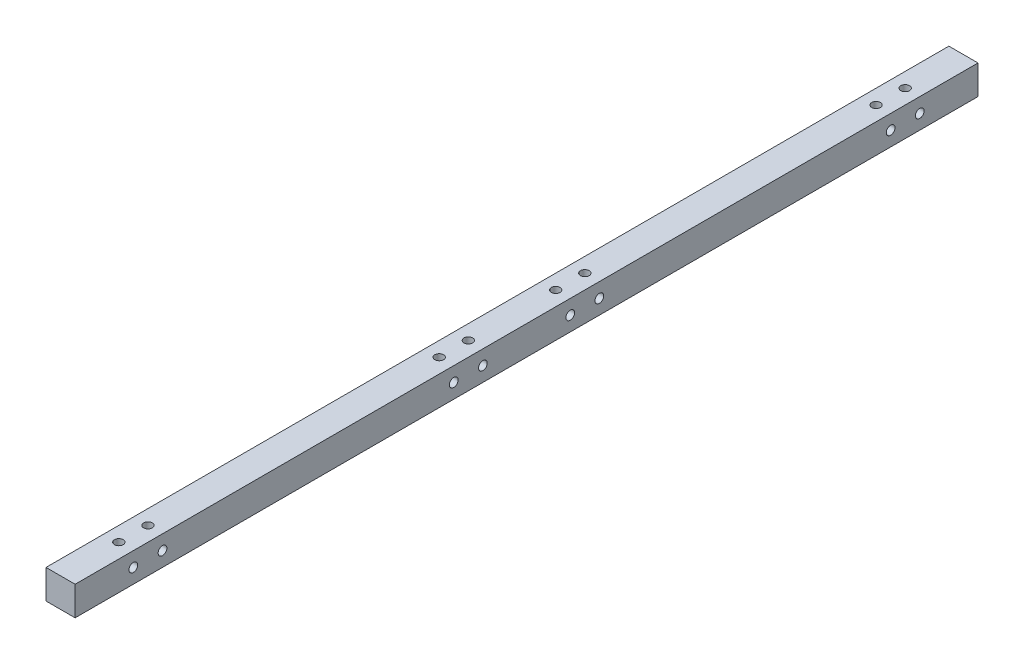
from build123d import *

# Parameters (mm, degrees)
ESQUISSE1_W             = 10
ESQUISSE1_H             = 10
EXTRUSION1_DEPTH        = 310
ESQUISSE2_R             = 1.5
ENL_V_MAT_EXTRU_1_DEPTH = 311.322412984
ESQUISSE3_R             = 1.5
ENL_V_MAT_EXTRU_2_DEPTH = 311.322412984


with BuildPart() as part:
    # Esquisse1 → Extrusion1 (new body)
    with BuildSketch(Plane.XY):
        with Locations((5, 5)):
            Rectangle(ESQUISSE1_W, ESQUISSE1_H)
    extrude(amount=EXTRUSION1_DEPTH)

    # Esquisse2 → Enl_v. mat.-Extru.1 (cut, through all)
    with BuildSketch(Plane(origin=(10, 0, 0), x_dir=(0, 0, -1), z_dir=(1, 0, 0))):
        with Locations((-170, 5)):
            Circle(ESQUISSE2_R)
        with Locations((-180, 5)):
            Circle(ESQUISSE2_R)
        with Locations(Location((-280, 5, 0), (0, 0, 180))):
            Circle(ESQUISSE2_R)
        with Locations(Location((-290, 5, 0), (0, 0, 180))):
            Circle(ESQUISSE2_R)
        with Locations((-20, 5)):
            Circle(ESQUISSE2_R)
        with Locations((-30, 5)):
            Circle(ESQUISSE2_R)
        with Locations(Location((-130, 5, 0), (0, 0, 180))):
            Circle(ESQUISSE2_R)
        with Locations(Location((-140, 5, 0), (0, 0, 180))):
            Circle(ESQUISSE2_R)
    extrude(amount=-ENL_V_MAT_EXTRU_1_DEPTH, mode=Mode.SUBTRACT)

    # Esquisse3 → Enl_v. mat.-Extru.2 (cut, through all)
    with BuildSketch(Plane(origin=(0, 10, 0), x_dir=(-1, 0, 0), z_dir=(0, 1, 0))):
        with Locations(Location((-5, 140, 0), (0, 0, 90))):
            Circle(ESQUISSE3_R)
        with Locations(Location((-5, 130, 0), (0, 0, 90))):
            Circle(ESQUISSE3_R)
        with Locations(Location((-5, 20, 0), (0, 0, 270))):
            Circle(ESQUISSE3_R)
        with Locations(Location((-5, 30, 0), (0, 0, 270))):
            Circle(ESQUISSE3_R)
        with Locations(Location((-5, 170, 0), (0, 0, 270))):
            Circle(ESQUISSE3_R)
        with Locations(Location((-5, 180, 0), (0, 0, 270))):
            Circle(ESQUISSE3_R)
        with Locations(Location((-5, 280, 0), (0, 0, 90))):
            Circle(ESQUISSE3_R)
        with Locations(Location((-5, 290, 0), (0, 0, 90))):
            Circle(ESQUISSE3_R)
    extrude(amount=-ENL_V_MAT_EXTRU_2_DEPTH, mode=Mode.SUBTRACT)


solid = part.part
